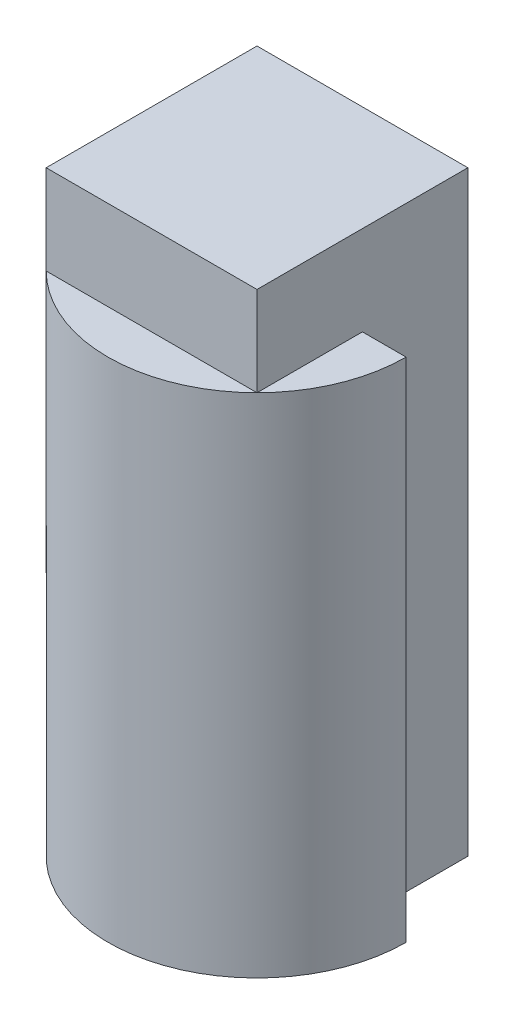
ISO-10303-21;
HEADER;
FILE_DESCRIPTION(('STEP AP214'),'2;1');
FILE_NAME('part.step','',(''),(''),'','','');
FILE_SCHEMA(('AUTOMOTIVE_DESIGN { 1 0 10303 214 1 1 1 1 }'));
ENDSEC;
DATA;
#1=APPLICATION_CONTEXT('core data for automotive mechanical design processes');
#2=APPLICATION_PROTOCOL_DEFINITION('international standard','automotive_design',2000,#1);
#3=PRODUCT_CONTEXT('',#1,'mechanical');
#4=PRODUCT('Part','Part','',(#3));
#5=PRODUCT_RELATED_PRODUCT_CATEGORY('part','',(#4));
#6=PRODUCT_DEFINITION_FORMATION('','',#4);
#7=PRODUCT_DEFINITION_CONTEXT('part definition',#1,'design');
#8=PRODUCT_DEFINITION('design','',#6,#7);
#9=PRODUCT_DEFINITION_SHAPE('','',#8);
#10=(LENGTH_UNIT() NAMED_UNIT(*) SI_UNIT(.MILLI.,.METRE.));
#11=(NAMED_UNIT(*) PLANE_ANGLE_UNIT() SI_UNIT($,.RADIAN.));
#12=(NAMED_UNIT(*) SI_UNIT($,.STERADIAN.) SOLID_ANGLE_UNIT());
#13=UNCERTAINTY_MEASURE_WITH_UNIT(LENGTH_MEASURE(1.E-05),#10,'distance_accuracy_value','');
#14=(GEOMETRIC_REPRESENTATION_CONTEXT(3) GLOBAL_UNCERTAINTY_ASSIGNED_CONTEXT((#13)) GLOBAL_UNIT_ASSIGNED_CONTEXT((#10,
#11,#12)) REPRESENTATION_CONTEXT('',''));
#15=CARTESIAN_POINT('',(0.,0.,0.));
#16=DIRECTION('',(0.,0.,1.));
#17=DIRECTION('',(1.,0.,0.));
#18=AXIS2_PLACEMENT_3D('',#15,#16,#17);
#19=CARTESIAN_POINT('',(0.,200.,0.));
#20=DIRECTION('',(0.,-1.,0.));
#21=DIRECTION('',(0.,0.,-1.));
#22=AXIS2_PLACEMENT_3D('',#19,#20,#21);
#23=CYLINDRICAL_SURFACE('',#22,50.);
#24=CARTESIAN_POINT('',(0.,170.,0.));
#25=DIRECTION('',(0.,1.,0.));
#26=DIRECTION('',(0.,0.,1.));
#27=AXIS2_PLACEMENT_3D('',#24,#25,#26);
#28=CIRCLE('',#27,50.);
#29=CARTESIAN_POINT('',(35.3553390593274,170.,-35.3553390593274));
#30=VERTEX_POINT('',#29);
#31=CARTESIAN_POINT('',(-35.3553390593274,170.,-35.3553390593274));
#32=VERTEX_POINT('',#31);
#33=EDGE_CURVE('E42',#30,#32,#28,.T.);
#34=ORIENTED_EDGE('',*,*,#33,.F.);
#35=DIRECTION('',(0.,1.,0.));
#36=VECTOR('',#35,1.);
#37=CARTESIAN_POINT('',(35.3553390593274,-10.,-35.3553390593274));
#38=LINE('',#37,#36);
#39=CARTESIAN_POINT('',(35.3553390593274,0.,-35.3553390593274));
#40=VERTEX_POINT('',#39);
#41=EDGE_CURVE('E100',#40,#30,#38,.T.);
#42=ORIENTED_EDGE('',*,*,#41,.F.);
#43=CARTESIAN_POINT('',(0.,0.,0.));
#44=DIRECTION('',(0.,1.,0.));
#45=DIRECTION('',(0.,0.,1.));
#46=AXIS2_PLACEMENT_3D('',#43,#44,#45);
#47=CIRCLE('',#46,50.);
#48=CARTESIAN_POINT('',(50.,0.,0.));
#49=VERTEX_POINT('',#48);
#50=EDGE_CURVE('E140',#40,#49,#47,.T.);
#51=ORIENTED_EDGE('',*,*,#50,.T.);
#52=DIRECTION('',(0.,-1.,0.));
#53=VECTOR('',#52,1.);
#54=CARTESIAN_POINT('',(50.,200.,0.));
#55=LINE('',#54,#53);
#56=CARTESIAN_POINT('',(50.,170.,0.));
#57=VERTEX_POINT('',#56);
#58=EDGE_CURVE('E165',#49,#57,#55,.F.);
#59=ORIENTED_EDGE('',*,*,#58,.T.);
#60=CARTESIAN_POINT('',(35.3553390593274,170.,35.3553390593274));
#61=VERTEX_POINT('',#60);
#62=EDGE_CURVE('E11',#61,#57,#28,.T.);
#63=ORIENTED_EDGE('',*,*,#62,.F.);
#64=CARTESIAN_POINT('',(-35.3553390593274,170.,35.3553390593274));
#65=VERTEX_POINT('',#64);
#66=EDGE_CURVE('E37',#65,#61,#28,.T.);
#67=ORIENTED_EDGE('',*,*,#66,.F.);
#68=EDGE_CURVE('E146',#32,#65,#28,.T.);
#69=ORIENTED_EDGE('',*,*,#68,.F.);
#70=EDGE_LOOP('',(#34,#42,#51,#59,#63,#67,#69));
#71=FACE_BOUND('',#70,.T.);
#72=ADVANCED_FACE('F34',(#71),#23,.T.);
#73=CARTESIAN_POINT('',(0.,0.,0.));
#74=DIRECTION('',(0.,1.,0.));
#75=DIRECTION('',(0.,0.,1.));
#76=AXIS2_PLACEMENT_3D('',#73,#74,#75);
#77=PLANE('',#76);
#78=CARTESIAN_POINT('',(0.,0.,0.));
#79=DIRECTION('',(0.,1.,0.));
#80=DIRECTION('',(0.,0.,1.));
#81=AXIS2_PLACEMENT_3D('',#78,#79,#80);
#82=CIRCLE('',#81,4.);
#83=CARTESIAN_POINT('',(0.,0.,4.));
#84=VERTEX_POINT('',#83);
#85=EDGE_CURVE('E142',#84,#84,#82,.F.);
#86=ORIENTED_EDGE('',*,*,#85,.F.);
#87=EDGE_LOOP('',(#86));
#88=FACE_BOUND('',#87,.T.);
#89=ORIENTED_EDGE('',*,*,#50,.F.);
#90=DIRECTION('',(0.,0.,1.));
#91=VECTOR('',#90,1.);
#92=CARTESIAN_POINT('',(35.3553390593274,0.,0.));
#93=LINE('',#92,#91);
#94=CARTESIAN_POINT('',(35.3553390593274,0.,0.));
#95=VERTEX_POINT('',#94);
#96=EDGE_CURVE('E124',#40,#95,#93,.T.);
#97=ORIENTED_EDGE('',*,*,#96,.T.);
#98=DIRECTION('',(1.,0.,0.));
#99=VECTOR('',#98,1.);
#100=CARTESIAN_POINT('',(0.,0.,0.));
#101=LINE('',#100,#99);
#102=EDGE_CURVE('E97',#95,#49,#101,.T.);
#103=ORIENTED_EDGE('',*,*,#102,.T.);
#104=EDGE_LOOP('',(#89,#97,#103));
#105=FACE_BOUND('',#104,.T.);
#106=ADVANCED_FACE('F172',(#88,#105),#77,.F.);
#107=CARTESIAN_POINT('',(0.,-10.,0.));
#108=DIRECTION('',(0.,1.,0.));
#109=DIRECTION('',(0.,0.,1.));
#110=AXIS2_PLACEMENT_3D('',#107,#108,#109);
#111=CYLINDRICAL_SURFACE('',#110,4.);
#112=CARTESIAN_POINT('',(0.,-10.,0.));
#113=DIRECTION('',(0.,-1.,0.));
#114=DIRECTION('',(0.,0.,-1.));
#115=AXIS2_PLACEMENT_3D('',#112,#113,#114);
#116=CIRCLE('',#115,4.);
#117=CARTESIAN_POINT('',(0.,-10.,-4.));
#118=VERTEX_POINT('',#117);
#119=EDGE_CURVE('E133',#118,#118,#116,.T.);
#120=ORIENTED_EDGE('',*,*,#119,.F.);
#121=EDGE_LOOP('',(#120));
#122=FACE_BOUND('',#121,.T.);
#123=ORIENTED_EDGE('',*,*,#85,.T.);
#124=EDGE_LOOP('',(#123));
#125=FACE_BOUND('',#124,.T.);
#126=ADVANCED_FACE('F174',(#122,#125),#111,.T.);
#127=CARTESIAN_POINT('',(0.,-10.,0.));
#128=DIRECTION('',(0.,-1.,0.));
#129=DIRECTION('',(0.,0.,-1.));
#130=AXIS2_PLACEMENT_3D('',#127,#128,#129);
#131=PLANE('',#130);
#132=ORIENTED_EDGE('',*,*,#119,.T.);
#133=EDGE_LOOP('',(#132));
#134=FACE_BOUND('',#133,.T.);
#135=ADVANCED_FACE('F181',(#134),#131,.T.);
#136=CARTESIAN_POINT('',(0.,170.,0.));
#137=DIRECTION('',(0.,1.,0.));
#138=DIRECTION('',(0.,0.,1.));
#139=AXIS2_PLACEMENT_3D('',#136,#137,#138);
#140=PLANE('',#139);
#141=DIRECTION('',(1.,0.,0.));
#142=VECTOR('',#141,1.);
#143=CARTESIAN_POINT('',(35.3553390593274,170.,0.));
#144=LINE('',#143,#142);
#145=CARTESIAN_POINT('',(35.3553390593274,170.,0.));
#146=VERTEX_POINT('',#145);
#147=EDGE_CURVE('E94',#146,#57,#144,.T.);
#148=ORIENTED_EDGE('',*,*,#147,.F.);
#149=DIRECTION('',(0.,0.,-1.));
#150=VECTOR('',#149,1.);
#151=CARTESIAN_POINT('',(35.3553390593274,170.,35.3553390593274));
#152=LINE('',#151,#150);
#153=EDGE_CURVE('E105',#61,#146,#152,.T.);
#154=ORIENTED_EDGE('',*,*,#153,.F.);
#155=ORIENTED_EDGE('',*,*,#62,.T.);
#156=EDGE_LOOP('',(#148,#154,#155));
#157=FACE_BOUND('',#156,.T.);
#158=ADVANCED_FACE('F104',(#157),#140,.T.);
#159=ORIENTED_EDGE('',*,*,#33,.T.);
#160=DIRECTION('',(-1.,0.,0.));
#161=VECTOR('',#160,1.);
#162=CARTESIAN_POINT('',(-35.3553390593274,170.,-35.3553390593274));
#163=LINE('',#162,#161);
#164=EDGE_CURVE('E111',#30,#32,#163,.T.);
#165=ORIENTED_EDGE('',*,*,#164,.F.);
#166=EDGE_LOOP('',(#159,#165));
#167=FACE_BOUND('',#166,.T.);
#168=ADVANCED_FACE('F155',(#167),#140,.T.);
#169=ORIENTED_EDGE('',*,*,#68,.T.);
#170=DIRECTION('',(0.,0.,1.));
#171=VECTOR('',#170,1.);
#172=CARTESIAN_POINT('',(-35.3553390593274,170.,35.3553390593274));
#173=LINE('',#172,#171);
#174=EDGE_CURVE('E49',#32,#65,#173,.T.);
#175=ORIENTED_EDGE('',*,*,#174,.F.);
#176=EDGE_LOOP('',(#169,#175));
#177=FACE_BOUND('',#176,.T.);
#178=ADVANCED_FACE('F162',(#177),#140,.T.);
#179=ORIENTED_EDGE('',*,*,#66,.T.);
#180=DIRECTION('',(1.,0.,0.));
#181=VECTOR('',#180,1.);
#182=CARTESIAN_POINT('',(-35.3553390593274,170.,35.3553390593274));
#183=LINE('',#182,#181);
#184=EDGE_CURVE('E112',#65,#61,#183,.T.);
#185=ORIENTED_EDGE('',*,*,#184,.F.);
#186=EDGE_LOOP('',(#179,#185));
#187=FACE_BOUND('',#186,.T.);
#188=ADVANCED_FACE('F194',(#187),#140,.T.);
#189=CARTESIAN_POINT('',(-35.3553390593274,170.,35.3553390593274));
#190=DIRECTION('',(-1.,0.,0.));
#191=DIRECTION('',(0.,0.,1.));
#192=AXIS2_PLACEMENT_3D('',#189,#190,#191);
#193=PLANE('',#192);
#194=DIRECTION('',(0.,0.,1.));
#195=VECTOR('',#194,1.);
#196=CARTESIAN_POINT('',(-35.3553390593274,200.,35.3553390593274));
#197=LINE('',#196,#195);
#198=CARTESIAN_POINT('',(-35.3553390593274,200.,-35.3553390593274));
#199=VERTEX_POINT('',#198);
#200=CARTESIAN_POINT('',(-35.3553390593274,200.,35.3553390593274));
#201=VERTEX_POINT('',#200);
#202=EDGE_CURVE('E120',#199,#201,#197,.T.);
#203=ORIENTED_EDGE('',*,*,#202,.F.);
#204=DIRECTION('',(0.,1.,0.));
#205=VECTOR('',#204,1.);
#206=CARTESIAN_POINT('',(-35.3553390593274,170.,-35.3553390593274));
#207=LINE('',#206,#205);
#208=EDGE_CURVE('E131',#32,#199,#207,.T.);
#209=ORIENTED_EDGE('',*,*,#208,.F.);
#210=ORIENTED_EDGE('',*,*,#174,.T.);
#211=DIRECTION('',(0.,1.,0.));
#212=VECTOR('',#211,1.);
#213=CARTESIAN_POINT('',(-35.3553390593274,170.,35.3553390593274));
#214=LINE('',#213,#212);
#215=EDGE_CURVE('E115',#65,#201,#214,.T.);
#216=ORIENTED_EDGE('',*,*,#215,.T.);
#217=EDGE_LOOP('',(#203,#209,#210,#216));
#218=FACE_BOUND('',#217,.T.);
#219=ADVANCED_FACE('F159',(#218),#193,.T.);
#220=CARTESIAN_POINT('',(-35.3553390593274,170.,-35.3553390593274));
#221=DIRECTION('',(0.,0.,-1.));
#222=DIRECTION('',(-1.,0.,0.));
#223=AXIS2_PLACEMENT_3D('',#220,#221,#222);
#224=PLANE('',#223);
#225=DIRECTION('',(-1.,0.,0.));
#226=VECTOR('',#225,1.);
#227=CARTESIAN_POINT('',(-35.3553390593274,200.,-35.3553390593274));
#228=LINE('',#227,#226);
#229=CARTESIAN_POINT('',(35.3553390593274,200.,-35.3553390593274));
#230=VERTEX_POINT('',#229);
#231=EDGE_CURVE('E128',#230,#199,#228,.T.);
#232=ORIENTED_EDGE('',*,*,#231,.F.);
#233=DIRECTION('',(0.,1.,0.));
#234=VECTOR('',#233,1.);
#235=CARTESIAN_POINT('',(35.3553390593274,170.,-35.3553390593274));
#236=LINE('',#235,#234);
#237=EDGE_CURVE('E134',#30,#230,#236,.T.);
#238=ORIENTED_EDGE('',*,*,#237,.F.);
#239=ORIENTED_EDGE('',*,*,#164,.T.);
#240=ORIENTED_EDGE('',*,*,#208,.T.);
#241=EDGE_LOOP('',(#232,#238,#239,#240));
#242=FACE_BOUND('',#241,.T.);
#243=ADVANCED_FACE('F164',(#242),#224,.T.);
#244=CARTESIAN_POINT('',(35.3553390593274,170.,35.3553390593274));
#245=DIRECTION('',(1.,0.,0.));
#246=DIRECTION('',(0.,0.,-1.));
#247=AXIS2_PLACEMENT_3D('',#244,#245,#246);
#248=PLANE('',#247);
#249=DIRECTION('',(0.,0.,-1.));
#250=VECTOR('',#249,1.);
#251=CARTESIAN_POINT('',(35.3553390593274,200.,35.3553390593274));
#252=LINE('',#251,#250);
#253=CARTESIAN_POINT('',(35.3553390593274,200.,35.3553390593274));
#254=VERTEX_POINT('',#253);
#255=EDGE_CURVE('E57',#254,#230,#252,.T.);
#256=ORIENTED_EDGE('',*,*,#255,.F.);
#257=DIRECTION('',(0.,1.,0.));
#258=VECTOR('',#257,1.);
#259=CARTESIAN_POINT('',(35.3553390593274,170.,35.3553390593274));
#260=LINE('',#259,#258);
#261=EDGE_CURVE('E109',#61,#254,#260,.T.);
#262=ORIENTED_EDGE('',*,*,#261,.F.);
#263=ORIENTED_EDGE('',*,*,#153,.T.);
#264=DIRECTION('',(0.,1.,0.));
#265=VECTOR('',#264,1.);
#266=CARTESIAN_POINT('',(35.3553390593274,-10.,0.));
#267=LINE('',#266,#265);
#268=EDGE_CURVE('E91',#95,#146,#267,.T.);
#269=ORIENTED_EDGE('',*,*,#268,.F.);
#270=ORIENTED_EDGE('',*,*,#96,.F.);
#271=ORIENTED_EDGE('',*,*,#41,.T.);
#272=ORIENTED_EDGE('',*,*,#237,.T.);
#273=EDGE_LOOP('',(#256,#262,#263,#269,#270,#271,#272));
#274=FACE_BOUND('',#273,.T.);
#275=ADVANCED_FACE('F108',(#274),#248,.T.);
#276=CARTESIAN_POINT('',(-35.3553390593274,170.,35.3553390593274));
#277=DIRECTION('',(0.,0.,1.));
#278=DIRECTION('',(1.,0.,0.));
#279=AXIS2_PLACEMENT_3D('',#276,#277,#278);
#280=PLANE('',#279);
#281=DIRECTION('',(1.,0.,0.));
#282=VECTOR('',#281,1.);
#283=CARTESIAN_POINT('',(-35.3553390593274,200.,35.3553390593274));
#284=LINE('',#283,#282);
#285=EDGE_CURVE('E123',#201,#254,#284,.T.);
#286=ORIENTED_EDGE('',*,*,#285,.F.);
#287=ORIENTED_EDGE('',*,*,#215,.F.);
#288=ORIENTED_EDGE('',*,*,#184,.T.);
#289=ORIENTED_EDGE('',*,*,#261,.T.);
#290=EDGE_LOOP('',(#286,#287,#288,#289));
#291=FACE_BOUND('',#290,.T.);
#292=ADVANCED_FACE('F187',(#291),#280,.T.);
#293=CARTESIAN_POINT('',(0.,200.,0.));
#294=DIRECTION('',(0.,1.,0.));
#295=DIRECTION('',(0.,0.,1.));
#296=AXIS2_PLACEMENT_3D('',#293,#294,#295);
#297=PLANE('',#296);
#298=ORIENTED_EDGE('',*,*,#231,.T.);
#299=ORIENTED_EDGE('',*,*,#202,.T.);
#300=ORIENTED_EDGE('',*,*,#285,.T.);
#301=ORIENTED_EDGE('',*,*,#255,.T.);
#302=EDGE_LOOP('',(#298,#299,#300,#301));
#303=FACE_BOUND('',#302,.T.);
#304=ADVANCED_FACE('F185',(#303),#297,.T.);
#305=CARTESIAN_POINT('',(35.3553390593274,-10.,0.));
#306=DIRECTION('',(0.,0.,1.));
#307=DIRECTION('',(1.,0.,0.));
#308=AXIS2_PLACEMENT_3D('',#305,#306,#307);
#309=PLANE('',#308);
#310=ORIENTED_EDGE('',*,*,#102,.F.);
#311=ORIENTED_EDGE('',*,*,#268,.T.);
#312=ORIENTED_EDGE('',*,*,#147,.T.);
#313=ORIENTED_EDGE('',*,*,#58,.F.);
#314=EDGE_LOOP('',(#310,#311,#312,#313));
#315=FACE_BOUND('',#314,.T.);
#316=ADVANCED_FACE('F93',(#315),#309,.F.);
#317=CLOSED_SHELL('',(#72,#106,#126,#135,#158,#168,#178,#188,#219,#243,#275,#292,#304,#316));
#318=MANIFOLD_SOLID_BREP('B2',#317);
#319=ADVANCED_BREP_SHAPE_REPRESENTATION('',(#18,#318),#14);
#320=SHAPE_DEFINITION_REPRESENTATION(#9,#319);
ENDSEC;
END-ISO-10303-21;
